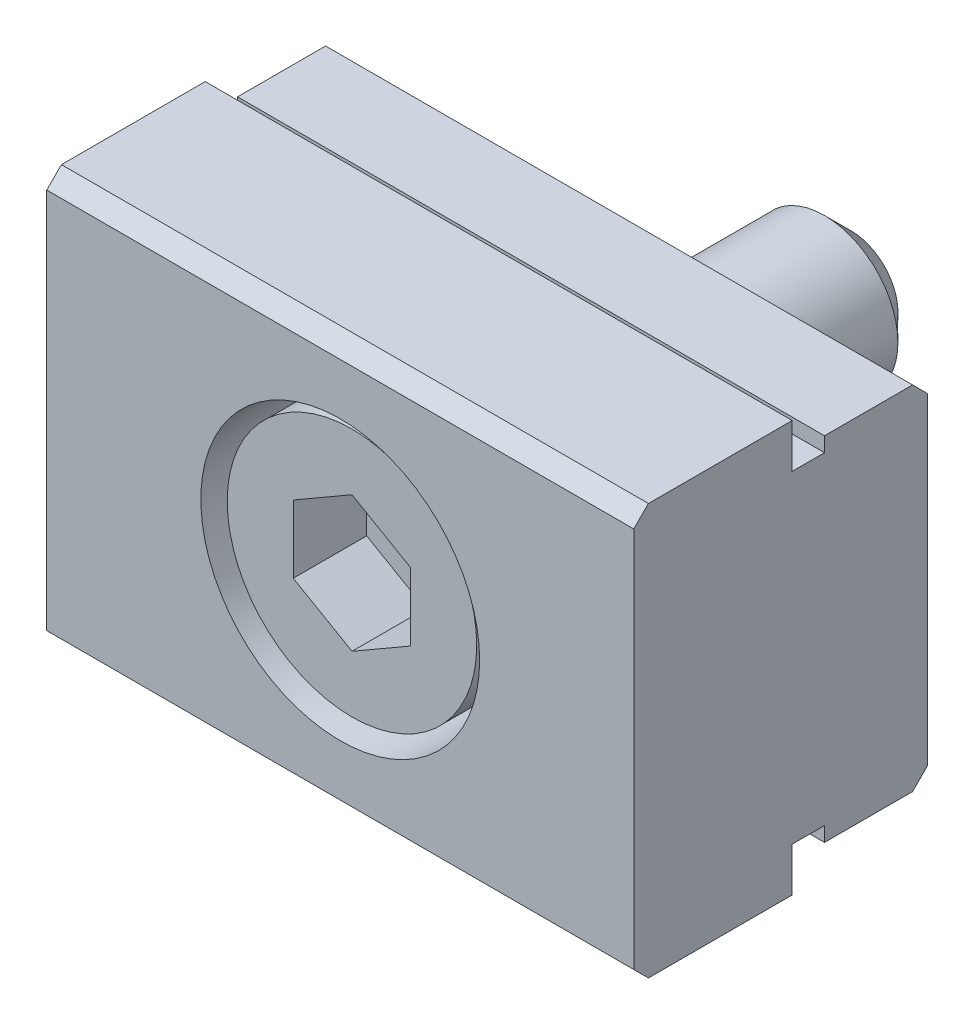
ISO-10303-21;
HEADER;
FILE_DESCRIPTION(('STEP AP214'),'2;1');
FILE_NAME('part.step','',(''),(''),'','','');
FILE_SCHEMA(('AUTOMOTIVE_DESIGN { 1 0 10303 214 1 1 1 1 }'));
ENDSEC;
DATA;
#1=APPLICATION_CONTEXT('core data for automotive mechanical design processes');
#2=APPLICATION_PROTOCOL_DEFINITION('international standard','automotive_design',2000,#1);
#3=PRODUCT_CONTEXT('',#1,'mechanical');
#4=PRODUCT('Part','Part','',(#3));
#5=PRODUCT_RELATED_PRODUCT_CATEGORY('part','',(#4));
#6=PRODUCT_DEFINITION_FORMATION('','',#4);
#7=PRODUCT_DEFINITION_CONTEXT('part definition',#1,'design');
#8=PRODUCT_DEFINITION('design','',#6,#7);
#9=PRODUCT_DEFINITION_SHAPE('','',#8);
#10=(LENGTH_UNIT() NAMED_UNIT(*) SI_UNIT(.MILLI.,.METRE.));
#11=(NAMED_UNIT(*) PLANE_ANGLE_UNIT() SI_UNIT($,.RADIAN.));
#12=(NAMED_UNIT(*) SI_UNIT($,.STERADIAN.) SOLID_ANGLE_UNIT());
#13=UNCERTAINTY_MEASURE_WITH_UNIT(LENGTH_MEASURE(1.E-05),#10,'distance_accuracy_value','');
#14=(GEOMETRIC_REPRESENTATION_CONTEXT(3) GLOBAL_UNCERTAINTY_ASSIGNED_CONTEXT((#13)) GLOBAL_UNIT_ASSIGNED_CONTEXT((#10,
#11,#12)) REPRESENTATION_CONTEXT('',''));
#15=CARTESIAN_POINT('',(0.,0.,0.));
#16=DIRECTION('',(0.,0.,1.));
#17=DIRECTION('',(1.,0.,0.));
#18=AXIS2_PLACEMENT_3D('',#15,#16,#17);
#19=CARTESIAN_POINT('',(2.5,0.,-12.));
#20=DIRECTION('',(0.,0.,-1.));
#21=DIRECTION('',(-1.,0.,0.));
#22=AXIS2_PLACEMENT_3D('',#19,#20,#21);
#23=PLANE('',#22);
#24=CARTESIAN_POINT('',(0.,0.,-12.));
#25=DIRECTION('',(0.,0.,-1.));
#26=DIRECTION('',(-1.,0.,0.));
#27=AXIS2_PLACEMENT_3D('',#24,#25,#26);
#28=CIRCLE('',#27,1.6);
#29=CARTESIAN_POINT('',(-1.6,0.,-12.));
#30=VERTEX_POINT('',#29);
#31=EDGE_CURVE('E24',#30,#30,#28,.T.);
#32=ORIENTED_EDGE('',*,*,#31,.T.);
#33=EDGE_LOOP('',(#32));
#34=FACE_BOUND('',#33,.T.);
#35=ADVANCED_FACE('F14',(#34),#23,.T.);
#36=CARTESIAN_POINT('',(0.,0.,-11.1));
#37=DIRECTION('',(0.,0.,1.));
#38=DIRECTION('',(1.,0.,0.));
#39=AXIS2_PLACEMENT_3D('',#36,#37,#38);
#40=CONICAL_SURFACE('',#39,2.5,0.785398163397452);
#41=ORIENTED_EDGE('',*,*,#31,.F.);
#42=EDGE_LOOP('',(#41));
#43=FACE_BOUND('',#42,.T.);
#44=CARTESIAN_POINT('',(0.,0.,-11.1));
#45=DIRECTION('',(0.,0.,-1.));
#46=DIRECTION('',(-1.,0.,0.));
#47=AXIS2_PLACEMENT_3D('',#44,#45,#46);
#48=CIRCLE('',#47,2.5);
#49=CARTESIAN_POINT('',(-2.5,0.,-11.1));
#50=VERTEX_POINT('',#49);
#51=EDGE_CURVE('E225',#50,#50,#48,.F.);
#52=ORIENTED_EDGE('',*,*,#51,.F.);
#53=EDGE_LOOP('',(#52));
#54=FACE_BOUND('',#53,.T.);
#55=ADVANCED_FACE('F397',(#43,#54),#40,.T.);
#56=CARTESIAN_POINT('',(0.,0.,8.));
#57=DIRECTION('',(0.,0.,1.));
#58=DIRECTION('',(1.,0.,0.));
#59=AXIS2_PLACEMENT_3D('',#56,#57,#58);
#60=CYLINDRICAL_SURFACE('',#59,2.5);
#61=ORIENTED_EDGE('',*,*,#51,.T.);
#62=EDGE_LOOP('',(#61));
#63=FACE_BOUND('',#62,.T.);
#64=CARTESIAN_POINT('',(0.,0.,0.));
#65=DIRECTION('',(0.,0.,1.));
#66=DIRECTION('',(1.,0.,0.));
#67=AXIS2_PLACEMENT_3D('',#64,#65,#66);
#68=CIRCLE('',#67,2.5);
#69=CARTESIAN_POINT('',(2.5,0.,0.));
#70=VERTEX_POINT('',#69);
#71=EDGE_CURVE('E216',#70,#70,#68,.T.);
#72=ORIENTED_EDGE('',*,*,#71,.F.);
#73=EDGE_LOOP('',(#72));
#74=FACE_BOUND('',#73,.T.);
#75=ADVANCED_FACE('F386',(#63,#74),#60,.T.);
#76=CARTESIAN_POINT('',(4.25,0.,0.));
#77=DIRECTION('',(0.,0.,-1.));
#78=DIRECTION('',(-1.,0.,0.));
#79=AXIS2_PLACEMENT_3D('',#76,#77,#78);
#80=PLANE('',#79);
#81=ORIENTED_EDGE('',*,*,#71,.T.);
#82=EDGE_LOOP('',(#81));
#83=FACE_BOUND('',#82,.T.);
#84=CARTESIAN_POINT('',(0.,0.,0.));
#85=DIRECTION('',(0.,0.,-1.));
#86=DIRECTION('',(-1.,0.,0.));
#87=AXIS2_PLACEMENT_3D('',#84,#85,#86);
#88=CIRCLE('',#87,2.75);
#89=CARTESIAN_POINT('',(-2.75,0.,0.));
#90=VERTEX_POINT('',#89);
#91=EDGE_CURVE('E9',#90,#90,#88,.T.);
#92=ORIENTED_EDGE('',*,*,#91,.T.);
#93=EDGE_LOOP('',(#92));
#94=FACE_BOUND('',#93,.T.);
#95=ADVANCED_FACE('F376',(#83,#94),#80,.T.);
#96=CARTESIAN_POINT('',(0.,2.3094010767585,2.5));
#97=DIRECTION('',(-0.5,-0.86602540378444,0.));
#98=DIRECTION('',(0.86602540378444,-0.5,0.));
#99=AXIS2_PLACEMENT_3D('',#96,#97,#98);
#100=PLANE('',#99);
#101=DIRECTION('',(0.,0.,1.));
#102=VECTOR('',#101,1.);
#103=CARTESIAN_POINT('',(2.,1.15470053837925,2.5));
#104=LINE('',#103,#102);
#105=CARTESIAN_POINT('',(2.,1.15470053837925,2.5));
#106=VERTEX_POINT('',#105);
#107=CARTESIAN_POINT('',(2.,1.15470053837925,5.));
#108=VERTEX_POINT('',#107);
#109=EDGE_CURVE('E145',#106,#108,#104,.T.);
#110=ORIENTED_EDGE('',*,*,#109,.T.);
#111=DIRECTION('',(0.86602540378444,-0.5,0.));
#112=VECTOR('',#111,1.);
#113=CARTESIAN_POINT('',(0.,2.3094010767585,5.));
#114=LINE('',#113,#112);
#115=CARTESIAN_POINT('',(0.,2.3094010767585,5.));
#116=VERTEX_POINT('',#115);
#117=EDGE_CURVE('E33',#116,#108,#114,.T.);
#118=ORIENTED_EDGE('',*,*,#117,.F.);
#119=DIRECTION('',(0.,0.,1.));
#120=VECTOR('',#119,1.);
#121=CARTESIAN_POINT('',(0.,2.3094010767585,2.5));
#122=LINE('',#121,#120);
#123=CARTESIAN_POINT('',(0.,2.3094010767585,2.5));
#124=VERTEX_POINT('',#123);
#125=EDGE_CURVE('E184',#124,#116,#122,.T.);
#126=ORIENTED_EDGE('',*,*,#125,.F.);
#127=DIRECTION('',(0.86602540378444,-0.5,0.));
#128=VECTOR('',#127,1.);
#129=CARTESIAN_POINT('',(0.,2.3094010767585,2.5));
#130=LINE('',#129,#128);
#131=EDGE_CURVE('E197',#124,#106,#130,.T.);
#132=ORIENTED_EDGE('',*,*,#131,.T.);
#133=EDGE_LOOP('',(#110,#118,#126,#132));
#134=FACE_BOUND('',#133,.T.);
#135=ADVANCED_FACE('F374',(#134),#100,.T.);
#136=CARTESIAN_POINT('',(2.,-1.15470053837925,2.5));
#137=DIRECTION('',(1.,0.,0.));
#138=DIRECTION('',(0.,0.,-1.));
#139=AXIS2_PLACEMENT_3D('',#136,#137,#138);
#140=PLANE('',#139);
#141=DIRECTION('',(0.,0.,1.));
#142=VECTOR('',#141,1.);
#143=CARTESIAN_POINT('',(2.,-1.15470053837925,2.5));
#144=LINE('',#143,#142);
#145=CARTESIAN_POINT('',(2.,-1.15470053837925,2.5));
#146=VERTEX_POINT('',#145);
#147=CARTESIAN_POINT('',(2.,-1.15470053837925,5.));
#148=VERTEX_POINT('',#147);
#149=EDGE_CURVE('E213',#146,#148,#144,.T.);
#150=ORIENTED_EDGE('',*,*,#149,.T.);
#151=DIRECTION('',(0.,1.,0.));
#152=VECTOR('',#151,1.);
#153=CARTESIAN_POINT('',(2.,-1.15470053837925,5.));
#154=LINE('',#153,#152);
#155=EDGE_CURVE('E351',#148,#108,#154,.T.);
#156=ORIENTED_EDGE('',*,*,#155,.T.);
#157=ORIENTED_EDGE('',*,*,#109,.F.);
#158=DIRECTION('',(0.,1.,0.));
#159=VECTOR('',#158,1.);
#160=CARTESIAN_POINT('',(2.,-1.15470053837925,2.5));
#161=LINE('',#160,#159);
#162=EDGE_CURVE('E207',#146,#106,#161,.T.);
#163=ORIENTED_EDGE('',*,*,#162,.F.);
#164=EDGE_LOOP('',(#150,#156,#157,#163));
#165=FACE_BOUND('',#164,.T.);
#166=ADVANCED_FACE('F373',(#165),#140,.F.);
#167=CARTESIAN_POINT('',(0.,-2.3094010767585,2.5));
#168=DIRECTION('',(0.5,-0.86602540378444,0.));
#169=DIRECTION('',(0.86602540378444,0.5,0.));
#170=AXIS2_PLACEMENT_3D('',#167,#168,#169);
#171=PLANE('',#170);
#172=DIRECTION('',(0.,0.,1.));
#173=VECTOR('',#172,1.);
#174=CARTESIAN_POINT('',(0.,-2.3094010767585,2.5));
#175=LINE('',#174,#173);
#176=CARTESIAN_POINT('',(0.,-2.3094010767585,2.5));
#177=VERTEX_POINT('',#176);
#178=CARTESIAN_POINT('',(0.,-2.3094010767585,5.));
#179=VERTEX_POINT('',#178);
#180=EDGE_CURVE('E211',#177,#179,#175,.T.);
#181=ORIENTED_EDGE('',*,*,#180,.T.);
#182=DIRECTION('',(0.86602540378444,0.5,0.));
#183=VECTOR('',#182,1.);
#184=CARTESIAN_POINT('',(0.,-2.3094010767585,5.));
#185=LINE('',#184,#183);
#186=EDGE_CURVE('E354',#179,#148,#185,.T.);
#187=ORIENTED_EDGE('',*,*,#186,.T.);
#188=ORIENTED_EDGE('',*,*,#149,.F.);
#189=DIRECTION('',(0.86602540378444,0.5,0.));
#190=VECTOR('',#189,1.);
#191=CARTESIAN_POINT('',(0.,-2.3094010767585,2.5));
#192=LINE('',#191,#190);
#193=EDGE_CURVE('E204',#177,#146,#192,.T.);
#194=ORIENTED_EDGE('',*,*,#193,.F.);
#195=EDGE_LOOP('',(#181,#187,#188,#194));
#196=FACE_BOUND('',#195,.T.);
#197=ADVANCED_FACE('F372',(#196),#171,.F.);
#198=CARTESIAN_POINT('',(0.,-2.3094010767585,2.5));
#199=DIRECTION('',(0.5,0.86602540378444,0.));
#200=DIRECTION('',(-0.86602540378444,0.5,0.));
#201=AXIS2_PLACEMENT_3D('',#198,#199,#200);
#202=PLANE('',#201);
#203=DIRECTION('',(0.,0.,1.));
#204=VECTOR('',#203,1.);
#205=CARTESIAN_POINT('',(-2.,-1.15470053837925,2.5));
#206=LINE('',#205,#204);
#207=CARTESIAN_POINT('',(-2.,-1.15470053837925,2.5));
#208=VERTEX_POINT('',#207);
#209=CARTESIAN_POINT('',(-2.,-1.15470053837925,5.));
#210=VERTEX_POINT('',#209);
#211=EDGE_CURVE('E183',#208,#210,#206,.T.);
#212=ORIENTED_EDGE('',*,*,#211,.T.);
#213=DIRECTION('',(-0.86602540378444,0.5,0.));
#214=VECTOR('',#213,1.);
#215=CARTESIAN_POINT('',(0.,-2.3094010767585,5.));
#216=LINE('',#215,#214);
#217=EDGE_CURVE('E357',#179,#210,#216,.T.);
#218=ORIENTED_EDGE('',*,*,#217,.F.);
#219=ORIENTED_EDGE('',*,*,#180,.F.);
#220=DIRECTION('',(-0.86602540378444,0.5,0.));
#221=VECTOR('',#220,1.);
#222=CARTESIAN_POINT('',(0.,-2.3094010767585,2.5));
#223=LINE('',#222,#221);
#224=EDGE_CURVE('E192',#177,#208,#223,.T.);
#225=ORIENTED_EDGE('',*,*,#224,.T.);
#226=EDGE_LOOP('',(#212,#218,#219,#225));
#227=FACE_BOUND('',#226,.T.);
#228=ADVANCED_FACE('F368',(#227),#202,.T.);
#229=CARTESIAN_POINT('',(-2.,1.15470053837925,2.5));
#230=DIRECTION('',(-1.,0.,0.));
#231=DIRECTION('',(0.,-1.,0.));
#232=AXIS2_PLACEMENT_3D('',#229,#230,#231);
#233=PLANE('',#232);
#234=DIRECTION('',(0.,0.,1.));
#235=VECTOR('',#234,1.);
#236=CARTESIAN_POINT('',(-2.,1.15470053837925,2.5));
#237=LINE('',#236,#235);
#238=CARTESIAN_POINT('',(-2.,1.15470053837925,2.5));
#239=VERTEX_POINT('',#238);
#240=CARTESIAN_POINT('',(-2.,1.15470053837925,5.));
#241=VERTEX_POINT('',#240);
#242=EDGE_CURVE('E173',#239,#241,#237,.T.);
#243=ORIENTED_EDGE('',*,*,#242,.T.);
#244=DIRECTION('',(0.,-1.,0.));
#245=VECTOR('',#244,1.);
#246=CARTESIAN_POINT('',(-2.,1.15470053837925,5.));
#247=LINE('',#246,#245);
#248=EDGE_CURVE('E362',#241,#210,#247,.T.);
#249=ORIENTED_EDGE('',*,*,#248,.T.);
#250=ORIENTED_EDGE('',*,*,#211,.F.);
#251=DIRECTION('',(0.,-1.,0.));
#252=VECTOR('',#251,1.);
#253=CARTESIAN_POINT('',(-2.,1.15470053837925,2.5));
#254=LINE('',#253,#252);
#255=EDGE_CURVE('E187',#239,#208,#254,.T.);
#256=ORIENTED_EDGE('',*,*,#255,.F.);
#257=EDGE_LOOP('',(#243,#249,#250,#256));
#258=FACE_BOUND('',#257,.T.);
#259=ADVANCED_FACE('F188',(#258),#233,.F.);
#260=CARTESIAN_POINT('',(0.,2.3094010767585,2.5));
#261=DIRECTION('',(-0.5,0.86602540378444,0.));
#262=DIRECTION('',(-0.86602540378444,-0.5,0.));
#263=AXIS2_PLACEMENT_3D('',#260,#261,#262);
#264=PLANE('',#263);
#265=DIRECTION('',(-0.86602540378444,-0.5,0.));
#266=VECTOR('',#265,1.);
#267=CARTESIAN_POINT('',(0.,2.3094010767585,2.5));
#268=LINE('',#267,#266);
#269=EDGE_CURVE('E177',#124,#239,#268,.T.);
#270=ORIENTED_EDGE('',*,*,#269,.F.);
#271=ORIENTED_EDGE('',*,*,#125,.T.);
#272=DIRECTION('',(-0.86602540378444,-0.5,0.));
#273=VECTOR('',#272,1.);
#274=CARTESIAN_POINT('',(0.,2.3094010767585,5.));
#275=LINE('',#274,#273);
#276=EDGE_CURVE('E179',#116,#241,#275,.T.);
#277=ORIENTED_EDGE('',*,*,#276,.T.);
#278=ORIENTED_EDGE('',*,*,#242,.F.);
#279=EDGE_LOOP('',(#270,#271,#277,#278));
#280=FACE_BOUND('',#279,.T.);
#281=ADVANCED_FACE('F175',(#280),#264,.F.);
#282=CARTESIAN_POINT('',(-2.,3.46410161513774,2.5));
#283=DIRECTION('',(0.,0.,-1.));
#284=DIRECTION('',(-1.,0.,0.));
#285=AXIS2_PLACEMENT_3D('',#282,#283,#284);
#286=PLANE('',#285);
#287=ORIENTED_EDGE('',*,*,#131,.F.);
#288=ORIENTED_EDGE('',*,*,#269,.T.);
#289=ORIENTED_EDGE('',*,*,#255,.T.);
#290=ORIENTED_EDGE('',*,*,#224,.F.);
#291=ORIENTED_EDGE('',*,*,#193,.T.);
#292=ORIENTED_EDGE('',*,*,#162,.T.);
#293=EDGE_LOOP('',(#287,#288,#289,#290,#291,#292));
#294=FACE_BOUND('',#293,.T.);
#295=ADVANCED_FACE('F195',(#294),#286,.F.);
#296=CARTESIAN_POINT('',(0.,0.,5.));
#297=DIRECTION('',(0.,0.,1.));
#298=DIRECTION('',(1.,0.,0.));
#299=AXIS2_PLACEMENT_3D('',#296,#297,#298);
#300=PLANE('',#299);
#301=CARTESIAN_POINT('',(0.,0.,5.));
#302=DIRECTION('',(0.,0.,1.));
#303=DIRECTION('',(1.,0.,0.));
#304=AXIS2_PLACEMENT_3D('',#301,#302,#303);
#305=CIRCLE('',#304,4.25);
#306=CARTESIAN_POINT('',(4.25,0.,5.));
#307=VERTEX_POINT('',#306);
#308=EDGE_CURVE('E222',#307,#307,#305,.T.);
#309=ORIENTED_EDGE('',*,*,#308,.T.);
#310=EDGE_LOOP('',(#309));
#311=FACE_BOUND('',#310,.T.);
#312=ORIENTED_EDGE('',*,*,#276,.F.);
#313=ORIENTED_EDGE('',*,*,#117,.T.);
#314=ORIENTED_EDGE('',*,*,#155,.F.);
#315=ORIENTED_EDGE('',*,*,#186,.F.);
#316=ORIENTED_EDGE('',*,*,#217,.T.);
#317=ORIENTED_EDGE('',*,*,#248,.F.);
#318=EDGE_LOOP('',(#312,#313,#314,#315,#316,#317));
#319=FACE_BOUND('',#318,.T.);
#320=ADVANCED_FACE('F366',(#311,#319),#300,.T.);
#321=CARTESIAN_POINT('',(0.,0.,8.));
#322=DIRECTION('',(0.,0.,1.));
#323=DIRECTION('',(1.,0.,0.));
#324=AXIS2_PLACEMENT_3D('',#321,#322,#323);
#325=CYLINDRICAL_SURFACE('',#324,4.25);
#326=CARTESIAN_POINT('',(0.,0.,0.));
#327=DIRECTION('',(0.,0.,1.));
#328=DIRECTION('',(1.,0.,0.));
#329=AXIS2_PLACEMENT_3D('',#326,#327,#328);
#330=CIRCLE('',#329,4.25);
#331=CARTESIAN_POINT('',(4.25,0.,0.));
#332=VERTEX_POINT('',#331);
#333=EDGE_CURVE('E219',#332,#332,#330,.T.);
#334=ORIENTED_EDGE('',*,*,#333,.T.);
#335=EDGE_LOOP('',(#334));
#336=FACE_BOUND('',#335,.T.);
#337=ORIENTED_EDGE('',*,*,#308,.F.);
#338=EDGE_LOOP('',(#337));
#339=FACE_BOUND('',#338,.T.);
#340=ADVANCED_FACE('F411',(#336,#339),#325,.T.);
#341=CARTESIAN_POINT('',(-12.5,-6.,-1.1));
#342=DIRECTION('',(0.,0.,-1.));
#343=DIRECTION('',(-1.,0.,0.));
#344=AXIS2_PLACEMENT_3D('',#341,#342,#343);
#345=PLANE('',#344);
#346=DIRECTION('',(0.,1.,0.));
#347=VECTOR('',#346,1.);
#348=CARTESIAN_POINT('',(-10.,-6.,-1.1));
#349=LINE('',#348,#347);
#350=CARTESIAN_POINT('',(-10.,-6.,-1.1));
#351=VERTEX_POINT('',#350);
#352=CARTESIAN_POINT('',(-10.,-5.5,-1.1));
#353=VERTEX_POINT('',#352);
#354=EDGE_CURVE('E300',#351,#353,#349,.T.);
#355=ORIENTED_EDGE('',*,*,#354,.F.);
#356=DIRECTION('',(1.,0.,0.));
#357=VECTOR('',#356,1.);
#358=CARTESIAN_POINT('',(-12.5,-6.,-1.1));
#359=LINE('',#358,#357);
#360=CARTESIAN_POINT('',(10.,-6.,-1.1));
#361=VERTEX_POINT('',#360);
#362=EDGE_CURVE('E335',#351,#361,#359,.T.);
#363=ORIENTED_EDGE('',*,*,#362,.T.);
#364=DIRECTION('',(0.,-1.,0.));
#365=VECTOR('',#364,1.);
#366=CARTESIAN_POINT('',(10.,-6.,-1.1));
#367=LINE('',#366,#365);
#368=CARTESIAN_POINT('',(10.,-5.5,-1.1));
#369=VERTEX_POINT('',#368);
#370=EDGE_CURVE('E279',#369,#361,#367,.T.);
#371=ORIENTED_EDGE('',*,*,#370,.F.);
#372=DIRECTION('',(1.,0.,0.));
#373=VECTOR('',#372,1.);
#374=CARTESIAN_POINT('',(-12.5,-5.5,-1.1));
#375=LINE('',#374,#373);
#376=EDGE_CURVE('E332',#353,#369,#375,.T.);
#377=ORIENTED_EDGE('',*,*,#376,.F.);
#378=EDGE_LOOP('',(#355,#363,#371,#377));
#379=FACE_BOUND('',#378,.T.);
#380=ADVANCED_FACE('F414',(#379),#345,.F.);
#381=CARTESIAN_POINT('',(-12.5,-6.,-4.1));
#382=DIRECTION('',(0.,1.,0.));
#383=DIRECTION('',(1.,0.,0.));
#384=AXIS2_PLACEMENT_3D('',#381,#382,#383);
#385=PLANE('',#384);
#386=DIRECTION('',(0.,0.,1.));
#387=VECTOR('',#386,1.);
#388=CARTESIAN_POINT('',(-10.,-6.,-4.1));
#389=LINE('',#388,#387);
#390=CARTESIAN_POINT('',(-10.,-6.,-4.1));
#391=VERTEX_POINT('',#390);
#392=EDGE_CURVE('E298',#391,#351,#389,.T.);
#393=ORIENTED_EDGE('',*,*,#392,.F.);
#394=DIRECTION('',(1.,0.,0.));
#395=VECTOR('',#394,1.);
#396=CARTESIAN_POINT('',(-12.5,-6.,-4.1));
#397=LINE('',#396,#395);
#398=CARTESIAN_POINT('',(10.,-6.,-4.1));
#399=VERTEX_POINT('',#398);
#400=EDGE_CURVE('E338',#391,#399,#397,.T.);
#401=ORIENTED_EDGE('',*,*,#400,.T.);
#402=DIRECTION('',(0.,0.,-1.));
#403=VECTOR('',#402,1.);
#404=CARTESIAN_POINT('',(10.,-6.,-4.1));
#405=LINE('',#404,#403);
#406=EDGE_CURVE('E277',#361,#399,#405,.T.);
#407=ORIENTED_EDGE('',*,*,#406,.F.);
#408=ORIENTED_EDGE('',*,*,#362,.F.);
#409=EDGE_LOOP('',(#393,#401,#407,#408));
#410=FACE_BOUND('',#409,.T.);
#411=ADVANCED_FACE('F451',(#410),#385,.F.);
#412=CARTESIAN_POINT('',(-12.5,6.,-4.1));
#413=DIRECTION('',(0.,-1.,0.));
#414=DIRECTION('',(-1.,0.,0.));
#415=AXIS2_PLACEMENT_3D('',#412,#413,#414);
#416=PLANE('',#415);
#417=DIRECTION('',(0.,0.,-1.));
#418=VECTOR('',#417,1.);
#419=CARTESIAN_POINT('',(-10.,6.,-4.1));
#420=LINE('',#419,#418);
#421=CARTESIAN_POINT('',(-10.,6.,-1.1));
#422=VERTEX_POINT('',#421);
#423=CARTESIAN_POINT('',(-10.,6.,-4.1));
#424=VERTEX_POINT('',#423);
#425=EDGE_CURVE('E348',#422,#424,#420,.T.);
#426=ORIENTED_EDGE('',*,*,#425,.F.);
#427=DIRECTION('',(1.,0.,0.));
#428=VECTOR('',#427,1.);
#429=CARTESIAN_POINT('',(-12.5,6.,-1.1));
#430=LINE('',#429,#428);
#431=CARTESIAN_POINT('',(10.,6.,-1.1));
#432=VERTEX_POINT('',#431);
#433=EDGE_CURVE('E314',#422,#432,#430,.T.);
#434=ORIENTED_EDGE('',*,*,#433,.T.);
#435=DIRECTION('',(0.,0.,1.));
#436=VECTOR('',#435,1.);
#437=CARTESIAN_POINT('',(10.,6.,-4.1));
#438=LINE('',#437,#436);
#439=CARTESIAN_POINT('',(10.,6.,-4.1));
#440=VERTEX_POINT('',#439);
#441=EDGE_CURVE('E347',#440,#432,#438,.T.);
#442=ORIENTED_EDGE('',*,*,#441,.F.);
#443=DIRECTION('',(1.,0.,0.));
#444=VECTOR('',#443,1.);
#445=CARTESIAN_POINT('',(-12.5,6.,-4.1));
#446=LINE('',#445,#444);
#447=EDGE_CURVE('E311',#424,#440,#446,.T.);
#448=ORIENTED_EDGE('',*,*,#447,.F.);
#449=EDGE_LOOP('',(#426,#434,#442,#448));
#450=FACE_BOUND('',#449,.T.);
#451=ADVANCED_FACE('F445',(#450),#416,.F.);
#452=CARTESIAN_POINT('',(-12.5,6.,-1.1));
#453=DIRECTION('',(0.,0.,-1.));
#454=DIRECTION('',(-1.,0.,0.));
#455=AXIS2_PLACEMENT_3D('',#452,#453,#454);
#456=PLANE('',#455);
#457=DIRECTION('',(0.,1.,0.));
#458=VECTOR('',#457,1.);
#459=CARTESIAN_POINT('',(-10.,6.,-1.1));
#460=LINE('',#459,#458);
#461=CARTESIAN_POINT('',(-10.,5.5,-1.1));
#462=VERTEX_POINT('',#461);
#463=EDGE_CURVE('E132',#462,#422,#460,.T.);
#464=ORIENTED_EDGE('',*,*,#463,.F.);
#465=DIRECTION('',(1.,0.,0.));
#466=VECTOR('',#465,1.);
#467=CARTESIAN_POINT('',(-12.5,5.5,-1.1));
#468=LINE('',#467,#466);
#469=CARTESIAN_POINT('',(10.,5.5,-1.1));
#470=VERTEX_POINT('',#469);
#471=EDGE_CURVE('E317',#462,#470,#468,.T.);
#472=ORIENTED_EDGE('',*,*,#471,.T.);
#473=DIRECTION('',(0.,-1.,0.));
#474=VECTOR('',#473,1.);
#475=CARTESIAN_POINT('',(10.,6.,-1.1));
#476=LINE('',#475,#474);
#477=EDGE_CURVE('E267',#432,#470,#476,.T.);
#478=ORIENTED_EDGE('',*,*,#477,.F.);
#479=ORIENTED_EDGE('',*,*,#433,.F.);
#480=EDGE_LOOP('',(#464,#472,#478,#479));
#481=FACE_BOUND('',#480,.T.);
#482=ADVANCED_FACE('F450',(#481),#456,.F.);
#483=CARTESIAN_POINT('',(-12.5,5.5,-1.1));
#484=DIRECTION('',(0.,-1.,0.));
#485=DIRECTION('',(-1.,0.,0.));
#486=AXIS2_PLACEMENT_3D('',#483,#484,#485);
#487=PLANE('',#486);
#488=DIRECTION('',(0.,0.,-1.));
#489=VECTOR('',#488,1.);
#490=CARTESIAN_POINT('',(-10.,5.5,-1.1));
#491=LINE('',#490,#489);
#492=CARTESIAN_POINT('',(-10.,5.5,0.));
#493=VERTEX_POINT('',#492);
#494=EDGE_CURVE('E290',#493,#462,#491,.T.);
#495=ORIENTED_EDGE('',*,*,#494,.F.);
#496=DIRECTION('',(-1.,0.,0.));
#497=VECTOR('',#496,1.);
#498=CARTESIAN_POINT('',(10.,5.5,0.));
#499=LINE('',#498,#497);
#500=CARTESIAN_POINT('',(10.,5.5,0.));
#501=VERTEX_POINT('',#500);
#502=EDGE_CURVE('E251',#501,#493,#499,.T.);
#503=ORIENTED_EDGE('',*,*,#502,.F.);
#504=DIRECTION('',(0.,0.,1.));
#505=VECTOR('',#504,1.);
#506=CARTESIAN_POINT('',(10.,5.5,-1.1));
#507=LINE('',#506,#505);
#508=EDGE_CURVE('E269',#470,#501,#507,.T.);
#509=ORIENTED_EDGE('',*,*,#508,.F.);
#510=ORIENTED_EDGE('',*,*,#471,.F.);
#511=EDGE_LOOP('',(#495,#503,#509,#510));
#512=FACE_BOUND('',#511,.T.);
#513=ADVANCED_FACE('F437',(#512),#487,.F.);
#514=CARTESIAN_POINT('',(10.,5.5,0.));
#515=DIRECTION('',(0.,0.,1.));
#516=DIRECTION('',(1.,0.,0.));
#517=AXIS2_PLACEMENT_3D('',#514,#515,#516);
#518=PLANE('',#517);
#519=DIRECTION('',(0.,1.,0.));
#520=VECTOR('',#519,1.);
#521=CARTESIAN_POINT('',(10.,5.5,0.));
#522=LINE('',#521,#520);
#523=CARTESIAN_POINT('',(10.,7.,0.));
#524=VERTEX_POINT('',#523);
#525=EDGE_CURVE('E248',#501,#524,#522,.T.);
#526=ORIENTED_EDGE('',*,*,#525,.F.);
#527=ORIENTED_EDGE('',*,*,#502,.T.);
#528=DIRECTION('',(0.,1.,0.));
#529=VECTOR('',#528,1.);
#530=CARTESIAN_POINT('',(-10.,5.5,0.));
#531=LINE('',#530,#529);
#532=CARTESIAN_POINT('',(-10.,7.,0.));
#533=VERTEX_POINT('',#532);
#534=EDGE_CURVE('E246',#493,#533,#531,.T.);
#535=ORIENTED_EDGE('',*,*,#534,.T.);
#536=DIRECTION('',(-1.,0.,0.));
#537=VECTOR('',#536,1.);
#538=CARTESIAN_POINT('',(-12.5,7.,0.));
#539=LINE('',#538,#537);
#540=EDGE_CURVE('E254',#524,#533,#539,.T.);
#541=ORIENTED_EDGE('',*,*,#540,.F.);
#542=EDGE_LOOP('',(#526,#527,#535,#541));
#543=FACE_BOUND('',#542,.T.);
#544=ADVANCED_FACE('F433',(#543),#518,.F.);
#545=CARTESIAN_POINT('',(-12.5,7.,-0.1));
#546=DIRECTION('',(0.,-1.,0.));
#547=DIRECTION('',(-1.,0.,0.));
#548=AXIS2_PLACEMENT_3D('',#545,#546,#547);
#549=PLANE('',#548);
#550=DIRECTION('',(0.,0.,-1.));
#551=VECTOR('',#550,1.);
#552=CARTESIAN_POINT('',(10.,7.,-14.6));
#553=LINE('',#552,#551);
#554=CARTESIAN_POINT('',(10.,7.,4.9));
#555=VERTEX_POINT('',#554);
#556=EDGE_CURVE('E259',#555,#524,#553,.T.);
#557=ORIENTED_EDGE('',*,*,#556,.T.);
#558=ORIENTED_EDGE('',*,*,#540,.T.);
#559=DIRECTION('',(0.,0.,1.));
#560=VECTOR('',#559,1.);
#561=CARTESIAN_POINT('',(-10.,7.,-14.6));
#562=LINE('',#561,#560);
#563=CARTESIAN_POINT('',(-10.,7.,4.9));
#564=VERTEX_POINT('',#563);
#565=EDGE_CURVE('E257',#533,#564,#562,.T.);
#566=ORIENTED_EDGE('',*,*,#565,.T.);
#567=DIRECTION('',(1.,0.,0.));
#568=VECTOR('',#567,1.);
#569=CARTESIAN_POINT('',(-12.5,7.,4.9));
#570=LINE('',#569,#568);
#571=EDGE_CURVE('E320',#564,#555,#570,.T.);
#572=ORIENTED_EDGE('',*,*,#571,.T.);
#573=EDGE_LOOP('',(#557,#558,#566,#572));
#574=FACE_BOUND('',#573,.T.);
#575=ADVANCED_FACE('F436',(#574),#549,.F.);
#576=CARTESIAN_POINT('',(-12.5,7.,4.9));
#577=DIRECTION('',(0.,-0.707106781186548,-0.707106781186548));
#578=DIRECTION('',(0.,-0.707106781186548,0.707106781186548));
#579=AXIS2_PLACEMENT_3D('',#576,#577,#578);
#580=PLANE('',#579);
#581=DIRECTION('',(0.,0.707106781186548,-0.707106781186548));
#582=VECTOR('',#581,1.);
#583=CARTESIAN_POINT('',(-10.,7.,4.9));
#584=LINE('',#583,#582);
#585=CARTESIAN_POINT('',(-10.,6.5,5.4));
#586=VERTEX_POINT('',#585);
#587=EDGE_CURVE('E304',#586,#564,#584,.T.);
#588=ORIENTED_EDGE('',*,*,#587,.F.);
#589=DIRECTION('',(1.,0.,0.));
#590=VECTOR('',#589,1.);
#591=CARTESIAN_POINT('',(-12.5,6.5,5.4));
#592=LINE('',#591,#590);
#593=CARTESIAN_POINT('',(10.,6.5,5.4));
#594=VERTEX_POINT('',#593);
#595=EDGE_CURVE('E323',#586,#594,#592,.T.);
#596=ORIENTED_EDGE('',*,*,#595,.T.);
#597=DIRECTION('',(0.,-0.707106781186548,0.707106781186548));
#598=VECTOR('',#597,1.);
#599=CARTESIAN_POINT('',(10.,7.,4.9));
#600=LINE('',#599,#598);
#601=EDGE_CURVE('E283',#555,#594,#600,.T.);
#602=ORIENTED_EDGE('',*,*,#601,.F.);
#603=ORIENTED_EDGE('',*,*,#571,.F.);
#604=EDGE_LOOP('',(#588,#596,#602,#603));
#605=FACE_BOUND('',#604,.T.);
#606=ADVANCED_FACE('F461',(#605),#580,.F.);
#607=CARTESIAN_POINT('',(-12.5,6.5,5.4));
#608=DIRECTION('',(0.,0.,-1.));
#609=DIRECTION('',(-1.,0.,0.));
#610=AXIS2_PLACEMENT_3D('',#607,#608,#609);
#611=PLANE('',#610);
#612=CARTESIAN_POINT('',(0.,0.,5.4));
#613=DIRECTION('',(0.,0.,1.));
#614=DIRECTION('',(1.,0.,0.));
#615=AXIS2_PLACEMENT_3D('',#612,#613,#614);
#616=CIRCLE('',#615,4.75);
#617=CARTESIAN_POINT('',(4.75,0.,5.4));
#618=VERTEX_POINT('',#617);
#619=EDGE_CURVE('E236',#618,#618,#616,.T.);
#620=ORIENTED_EDGE('',*,*,#619,.F.);
#621=EDGE_LOOP('',(#620));
#622=FACE_BOUND('',#621,.T.);
#623=DIRECTION('',(0.,1.,0.));
#624=VECTOR('',#623,1.);
#625=CARTESIAN_POINT('',(-10.,6.5,5.4));
#626=LINE('',#625,#624);
#627=CARTESIAN_POINT('',(-10.,-6.5,5.4));
#628=VERTEX_POINT('',#627);
#629=EDGE_CURVE('E307',#628,#586,#626,.T.);
#630=ORIENTED_EDGE('',*,*,#629,.F.);
#631=DIRECTION('',(1.,0.,0.));
#632=VECTOR('',#631,1.);
#633=CARTESIAN_POINT('',(-12.5,-6.5,5.4));
#634=LINE('',#633,#632);
#635=CARTESIAN_POINT('',(10.,-6.5,5.4));
#636=VERTEX_POINT('',#635);
#637=EDGE_CURVE('E326',#628,#636,#634,.T.);
#638=ORIENTED_EDGE('',*,*,#637,.T.);
#639=DIRECTION('',(0.,-1.,0.));
#640=VECTOR('',#639,1.);
#641=CARTESIAN_POINT('',(10.,6.5,5.4));
#642=LINE('',#641,#640);
#643=EDGE_CURVE('E285',#594,#636,#642,.T.);
#644=ORIENTED_EDGE('',*,*,#643,.F.);
#645=ORIENTED_EDGE('',*,*,#595,.F.);
#646=EDGE_LOOP('',(#630,#638,#644,#645));
#647=FACE_BOUND('',#646,.T.);
#648=ADVANCED_FACE('F426',(#622,#647),#611,.F.);
#649=CARTESIAN_POINT('',(0.,0.,5.4));
#650=DIRECTION('',(0.,0.,1.));
#651=DIRECTION('',(1.,0.,0.));
#652=AXIS2_PLACEMENT_3D('',#649,#650,#651);
#653=CYLINDRICAL_SURFACE('',#652,4.75);
#654=CARTESIAN_POINT('',(0.,0.,0.));
#655=DIRECTION('',(0.,0.,1.));
#656=DIRECTION('',(1.,0.,0.));
#657=AXIS2_PLACEMENT_3D('',#654,#655,#656);
#658=CIRCLE('',#657,4.75);
#659=CARTESIAN_POINT('',(4.75,0.,0.));
#660=VERTEX_POINT('',#659);
#661=EDGE_CURVE('E233',#660,#660,#658,.T.);
#662=ORIENTED_EDGE('',*,*,#661,.F.);
#663=EDGE_LOOP('',(#662));
#664=FACE_BOUND('',#663,.T.);
#665=ORIENTED_EDGE('',*,*,#619,.T.);
#666=EDGE_LOOP('',(#665));
#667=FACE_BOUND('',#666,.T.);
#668=ADVANCED_FACE('F422',(#664,#667),#653,.F.);
#669=CARTESIAN_POINT('',(-2.75,0.,0.));
#670=DIRECTION('',(0.,0.,-1.));
#671=DIRECTION('',(-1.,0.,0.));
#672=AXIS2_PLACEMENT_3D('',#669,#670,#671);
#673=PLANE('',#672);
#674=ORIENTED_EDGE('',*,*,#333,.F.);
#675=EDGE_LOOP('',(#674));
#676=FACE_BOUND('',#675,.T.);
#677=ORIENTED_EDGE('',*,*,#661,.T.);
#678=EDGE_LOOP('',(#677));
#679=FACE_BOUND('',#678,.T.);
#680=ADVANCED_FACE('F395',(#676,#679),#673,.F.);
#681=CARTESIAN_POINT('',(-12.5,-7.,4.9));
#682=DIRECTION('',(0.,0.707106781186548,-0.707106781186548));
#683=DIRECTION('',(0.,-0.707106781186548,-0.707106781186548));
#684=AXIS2_PLACEMENT_3D('',#681,#682,#683);
#685=PLANE('',#684);
#686=DIRECTION('',(0.,0.707106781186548,0.707106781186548));
#687=VECTOR('',#686,1.);
#688=CARTESIAN_POINT('',(-10.,-7.,4.9));
#689=LINE('',#688,#687);
#690=CARTESIAN_POINT('',(-10.,-7.,4.9));
#691=VERTEX_POINT('',#690);
#692=EDGE_CURVE('E309',#691,#628,#689,.T.);
#693=ORIENTED_EDGE('',*,*,#692,.F.);
#694=DIRECTION('',(1.,0.,0.));
#695=VECTOR('',#694,1.);
#696=CARTESIAN_POINT('',(-12.5,-7.,4.9));
#697=LINE('',#696,#695);
#698=CARTESIAN_POINT('',(10.,-7.,4.9));
#699=VERTEX_POINT('',#698);
#700=EDGE_CURVE('E329',#691,#699,#697,.T.);
#701=ORIENTED_EDGE('',*,*,#700,.T.);
#702=DIRECTION('',(0.,-0.707106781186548,-0.707106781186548));
#703=VECTOR('',#702,1.);
#704=CARTESIAN_POINT('',(10.,-7.,4.9));
#705=LINE('',#704,#703);
#706=EDGE_CURVE('E287',#636,#699,#705,.T.);
#707=ORIENTED_EDGE('',*,*,#706,.F.);
#708=ORIENTED_EDGE('',*,*,#637,.F.);
#709=EDGE_LOOP('',(#693,#701,#707,#708));
#710=FACE_BOUND('',#709,.T.);
#711=ADVANCED_FACE('F421',(#710),#685,.F.);
#712=CARTESIAN_POINT('',(-12.5,-7.,-0.1));
#713=DIRECTION('',(0.,1.,0.));
#714=DIRECTION('',(1.,0.,0.));
#715=AXIS2_PLACEMENT_3D('',#712,#713,#714);
#716=PLANE('',#715);
#717=DIRECTION('',(0.,0.,1.));
#718=VECTOR('',#717,1.);
#719=CARTESIAN_POINT('',(-10.,-7.,-14.6));
#720=LINE('',#719,#718);
#721=CARTESIAN_POINT('',(-10.,-7.,0.));
#722=VERTEX_POINT('',#721);
#723=EDGE_CURVE('E262',#722,#691,#720,.T.);
#724=ORIENTED_EDGE('',*,*,#723,.F.);
#725=DIRECTION('',(1.,0.,0.));
#726=VECTOR('',#725,1.);
#727=CARTESIAN_POINT('',(-12.5,-7.,0.));
#728=LINE('',#727,#726);
#729=CARTESIAN_POINT('',(10.,-7.,0.));
#730=VERTEX_POINT('',#729);
#731=EDGE_CURVE('E139',#722,#730,#728,.T.);
#732=ORIENTED_EDGE('',*,*,#731,.T.);
#733=DIRECTION('',(0.,0.,-1.));
#734=VECTOR('',#733,1.);
#735=CARTESIAN_POINT('',(10.,-7.,-14.6));
#736=LINE('',#735,#734);
#737=EDGE_CURVE('E264',#699,#730,#736,.T.);
#738=ORIENTED_EDGE('',*,*,#737,.F.);
#739=ORIENTED_EDGE('',*,*,#700,.F.);
#740=EDGE_LOOP('',(#724,#732,#738,#739));
#741=FACE_BOUND('',#740,.T.);
#742=ADVANCED_FACE('F432',(#741),#716,.F.);
#743=CARTESIAN_POINT('',(10.,-5.5,0.));
#744=DIRECTION('',(0.,0.,1.));
#745=DIRECTION('',(1.,0.,0.));
#746=AXIS2_PLACEMENT_3D('',#743,#744,#745);
#747=PLANE('',#746);
#748=DIRECTION('',(0.,1.,0.));
#749=VECTOR('',#748,1.);
#750=CARTESIAN_POINT('',(-10.,-7.,0.));
#751=LINE('',#750,#749);
#752=CARTESIAN_POINT('',(-10.,-5.5,0.));
#753=VERTEX_POINT('',#752);
#754=EDGE_CURVE('E18',#722,#753,#751,.T.);
#755=ORIENTED_EDGE('',*,*,#754,.T.);
#756=DIRECTION('',(-1.,0.,0.));
#757=VECTOR('',#756,1.);
#758=CARTESIAN_POINT('',(10.,-5.5,0.));
#759=LINE('',#758,#757);
#760=CARTESIAN_POINT('',(10.,-5.5,0.));
#761=VERTEX_POINT('',#760);
#762=EDGE_CURVE('E242',#761,#753,#759,.T.);
#763=ORIENTED_EDGE('',*,*,#762,.F.);
#764=DIRECTION('',(0.,1.,0.));
#765=VECTOR('',#764,1.);
#766=CARTESIAN_POINT('',(10.,-5.5,0.));
#767=LINE('',#766,#765);
#768=EDGE_CURVE('E239',#730,#761,#767,.T.);
#769=ORIENTED_EDGE('',*,*,#768,.F.);
#770=ORIENTED_EDGE('',*,*,#731,.F.);
#771=EDGE_LOOP('',(#755,#763,#769,#770));
#772=FACE_BOUND('',#771,.T.);
#773=ADVANCED_FACE('F428',(#772),#747,.F.);
#774=CARTESIAN_POINT('',(-12.5,-5.5,-1.1));
#775=DIRECTION('',(0.,1.,0.));
#776=DIRECTION('',(1.,0.,0.));
#777=AXIS2_PLACEMENT_3D('',#774,#775,#776);
#778=PLANE('',#777);
#779=DIRECTION('',(0.,0.,1.));
#780=VECTOR('',#779,1.);
#781=CARTESIAN_POINT('',(-10.,-5.5,-1.1));
#782=LINE('',#781,#780);
#783=EDGE_CURVE('E302',#353,#753,#782,.T.);
#784=ORIENTED_EDGE('',*,*,#783,.F.);
#785=ORIENTED_EDGE('',*,*,#376,.T.);
#786=DIRECTION('',(0.,0.,-1.));
#787=VECTOR('',#786,1.);
#788=CARTESIAN_POINT('',(10.,-5.5,-1.1));
#789=LINE('',#788,#787);
#790=EDGE_CURVE('E281',#761,#369,#789,.T.);
#791=ORIENTED_EDGE('',*,*,#790,.F.);
#792=ORIENTED_EDGE('',*,*,#762,.T.);
#793=EDGE_LOOP('',(#784,#785,#791,#792));
#794=FACE_BOUND('',#793,.T.);
#795=ADVANCED_FACE('F431',(#794),#778,.F.);
#796=CARTESIAN_POINT('',(-12.5,-5.5,-4.6));
#797=DIRECTION('',(0.,0.707106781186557,0.707106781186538));
#798=DIRECTION('',(0.,0.707106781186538,-0.707106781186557));
#799=AXIS2_PLACEMENT_3D('',#796,#797,#798);
#800=PLANE('',#799);
#801=DIRECTION('',(0.,-0.707106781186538,0.707106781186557));
#802=VECTOR('',#801,1.);
#803=CARTESIAN_POINT('',(-10.,-5.5,-4.6));
#804=LINE('',#803,#802);
#805=CARTESIAN_POINT('',(-10.,-5.5,-4.6));
#806=VERTEX_POINT('',#805);
#807=EDGE_CURVE('E296',#806,#391,#804,.T.);
#808=ORIENTED_EDGE('',*,*,#807,.F.);
#809=DIRECTION('',(1.,0.,0.));
#810=VECTOR('',#809,1.);
#811=CARTESIAN_POINT('',(-12.5,-5.5,-4.6));
#812=LINE('',#811,#810);
#813=CARTESIAN_POINT('',(10.,-5.5,-4.6));
#814=VERTEX_POINT('',#813);
#815=EDGE_CURVE('E341',#806,#814,#812,.T.);
#816=ORIENTED_EDGE('',*,*,#815,.T.);
#817=DIRECTION('',(0.,0.707106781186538,-0.707106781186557));
#818=VECTOR('',#817,1.);
#819=CARTESIAN_POINT('',(10.,-5.5,-4.6));
#820=LINE('',#819,#818);
#821=EDGE_CURVE('E275',#399,#814,#820,.T.);
#822=ORIENTED_EDGE('',*,*,#821,.F.);
#823=ORIENTED_EDGE('',*,*,#400,.F.);
#824=EDGE_LOOP('',(#808,#816,#822,#823));
#825=FACE_BOUND('',#824,.T.);
#826=ADVANCED_FACE('F443',(#825),#800,.F.);
#827=CARTESIAN_POINT('',(10.,-7.,-14.6));
#828=DIRECTION('',(1.,0.,0.));
#829=DIRECTION('',(0.,-1.,0.));
#830=AXIS2_PLACEMENT_3D('',#827,#828,#829);
#831=PLANE('',#830);
#832=ORIENTED_EDGE('',*,*,#768,.T.);
#833=ORIENTED_EDGE('',*,*,#790,.T.);
#834=ORIENTED_EDGE('',*,*,#370,.T.);
#835=ORIENTED_EDGE('',*,*,#406,.T.);
#836=ORIENTED_EDGE('',*,*,#821,.T.);
#837=DIRECTION('',(0.,1.,0.));
#838=VECTOR('',#837,1.);
#839=CARTESIAN_POINT('',(10.,5.5,-4.6));
#840=LINE('',#839,#838);
#841=CARTESIAN_POINT('',(10.,5.5,-4.6));
#842=VERTEX_POINT('',#841);
#843=EDGE_CURVE('E273',#814,#842,#840,.T.);
#844=ORIENTED_EDGE('',*,*,#843,.T.);
#845=DIRECTION('',(0.,0.707106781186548,0.707106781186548));
#846=VECTOR('',#845,1.);
#847=CARTESIAN_POINT('',(10.,5.5,-4.6));
#848=LINE('',#847,#846);
#849=EDGE_CURVE('E271',#842,#440,#848,.T.);
#850=ORIENTED_EDGE('',*,*,#849,.T.);
#851=ORIENTED_EDGE('',*,*,#441,.T.);
#852=ORIENTED_EDGE('',*,*,#477,.T.);
#853=ORIENTED_EDGE('',*,*,#508,.T.);
#854=ORIENTED_EDGE('',*,*,#525,.T.);
#855=ORIENTED_EDGE('',*,*,#556,.F.);
#856=ORIENTED_EDGE('',*,*,#601,.T.);
#857=ORIENTED_EDGE('',*,*,#643,.T.);
#858=ORIENTED_EDGE('',*,*,#706,.T.);
#859=ORIENTED_EDGE('',*,*,#737,.T.);
#860=EDGE_LOOP('',(#832,#833,#834,#835,#836,#844,#850,#851,#852,#853,#854,#855,#856,#857,#858,#859));
#861=FACE_BOUND('',#860,.T.);
#862=ADVANCED_FACE('F440',(#861),#831,.T.);
#863=CARTESIAN_POINT('',(-12.5,5.5,-4.6));
#864=DIRECTION('',(0.,-0.707106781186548,0.707106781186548));
#865=DIRECTION('',(0.,0.707106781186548,0.707106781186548));
#866=AXIS2_PLACEMENT_3D('',#863,#864,#865);
#867=PLANE('',#866);
#868=DIRECTION('',(0.,-0.707106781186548,-0.707106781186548));
#869=VECTOR('',#868,1.);
#870=CARTESIAN_POINT('',(-10.,5.5,-4.6));
#871=LINE('',#870,#869);
#872=CARTESIAN_POINT('',(-10.,5.5,-4.6));
#873=VERTEX_POINT('',#872);
#874=EDGE_CURVE('E292',#424,#873,#871,.T.);
#875=ORIENTED_EDGE('',*,*,#874,.F.);
#876=ORIENTED_EDGE('',*,*,#447,.T.);
#877=ORIENTED_EDGE('',*,*,#849,.F.);
#878=DIRECTION('',(1.,0.,0.));
#879=VECTOR('',#878,1.);
#880=CARTESIAN_POINT('',(-12.5,5.5,-4.6));
#881=LINE('',#880,#879);
#882=EDGE_CURVE('E344',#873,#842,#881,.T.);
#883=ORIENTED_EDGE('',*,*,#882,.F.);
#884=EDGE_LOOP('',(#875,#876,#877,#883));
#885=FACE_BOUND('',#884,.T.);
#886=ADVANCED_FACE('F16',(#885),#867,.F.);
#887=CARTESIAN_POINT('',(-10.,-7.,-14.6));
#888=DIRECTION('',(-1.,0.,0.));
#889=DIRECTION('',(0.,1.,0.));
#890=AXIS2_PLACEMENT_3D('',#887,#888,#889);
#891=PLANE('',#890);
#892=ORIENTED_EDGE('',*,*,#783,.T.);
#893=ORIENTED_EDGE('',*,*,#754,.F.);
#894=ORIENTED_EDGE('',*,*,#723,.T.);
#895=ORIENTED_EDGE('',*,*,#692,.T.);
#896=ORIENTED_EDGE('',*,*,#629,.T.);
#897=ORIENTED_EDGE('',*,*,#587,.T.);
#898=ORIENTED_EDGE('',*,*,#565,.F.);
#899=ORIENTED_EDGE('',*,*,#534,.F.);
#900=ORIENTED_EDGE('',*,*,#494,.T.);
#901=ORIENTED_EDGE('',*,*,#463,.T.);
#902=ORIENTED_EDGE('',*,*,#425,.T.);
#903=ORIENTED_EDGE('',*,*,#874,.T.);
#904=DIRECTION('',(0.,-1.,0.));
#905=VECTOR('',#904,1.);
#906=CARTESIAN_POINT('',(-10.,5.5,-4.6));
#907=LINE('',#906,#905);
#908=EDGE_CURVE('E294',#873,#806,#907,.T.);
#909=ORIENTED_EDGE('',*,*,#908,.T.);
#910=ORIENTED_EDGE('',*,*,#807,.T.);
#911=ORIENTED_EDGE('',*,*,#392,.T.);
#912=ORIENTED_EDGE('',*,*,#354,.T.);
#913=EDGE_LOOP('',(#892,#893,#894,#895,#896,#897,#898,#899,#900,#901,#902,#903,#909,#910,#911,#912));
#914=FACE_BOUND('',#913,.T.);
#915=ADVANCED_FACE('F439',(#914),#891,.T.);
#916=CARTESIAN_POINT('',(-12.5,5.5,-4.6));
#917=DIRECTION('',(0.,0.,1.));
#918=DIRECTION('',(1.,0.,0.));
#919=AXIS2_PLACEMENT_3D('',#916,#917,#918);
#920=PLANE('',#919);
#921=CARTESIAN_POINT('',(0.,0.,-4.6));
#922=DIRECTION('',(0.,0.,1.));
#923=DIRECTION('',(1.,0.,0.));
#924=AXIS2_PLACEMENT_3D('',#921,#922,#923);
#925=CIRCLE('',#924,2.75);
#926=CARTESIAN_POINT('',(2.75,0.,-4.6));
#927=VERTEX_POINT('',#926);
#928=EDGE_CURVE('E230',#927,#927,#925,.T.);
#929=ORIENTED_EDGE('',*,*,#928,.T.);
#930=EDGE_LOOP('',(#929));
#931=FACE_BOUND('',#930,.T.);
#932=ORIENTED_EDGE('',*,*,#908,.F.);
#933=ORIENTED_EDGE('',*,*,#882,.T.);
#934=ORIENTED_EDGE('',*,*,#843,.F.);
#935=ORIENTED_EDGE('',*,*,#815,.F.);
#936=EDGE_LOOP('',(#932,#933,#934,#935));
#937=FACE_BOUND('',#936,.T.);
#938=ADVANCED_FACE('F392',(#931,#937),#920,.F.);
#939=CARTESIAN_POINT('',(0.,0.,5.4));
#940=DIRECTION('',(0.,0.,1.));
#941=DIRECTION('',(1.,0.,0.));
#942=AXIS2_PLACEMENT_3D('',#939,#940,#941);
#943=CYLINDRICAL_SURFACE('',#942,2.75);
#944=ORIENTED_EDGE('',*,*,#928,.F.);
#945=EDGE_LOOP('',(#944));
#946=FACE_BOUND('',#945,.T.);
#947=ORIENTED_EDGE('',*,*,#91,.F.);
#948=EDGE_LOOP('',(#947));
#949=FACE_BOUND('',#948,.T.);
#950=ADVANCED_FACE('F378',(#946,#949),#943,.F.);
#951=CLOSED_SHELL('',(#35,#55,#75,#95,#135,#166,#197,#228,#259,#281,#295,#320,#340,#380,#411,
#451,#482,#513,#544,#575,#606,#648,#668,#680,#711,#742,#773,#795,#826,#862,#886,#915,#938,#950));
#952=MANIFOLD_SOLID_BREP('B1',#951);
#953=ADVANCED_BREP_SHAPE_REPRESENTATION('',(#18,#952),#14);
#954=SHAPE_DEFINITION_REPRESENTATION(#9,#953);
ENDSEC;
END-ISO-10303-21;
